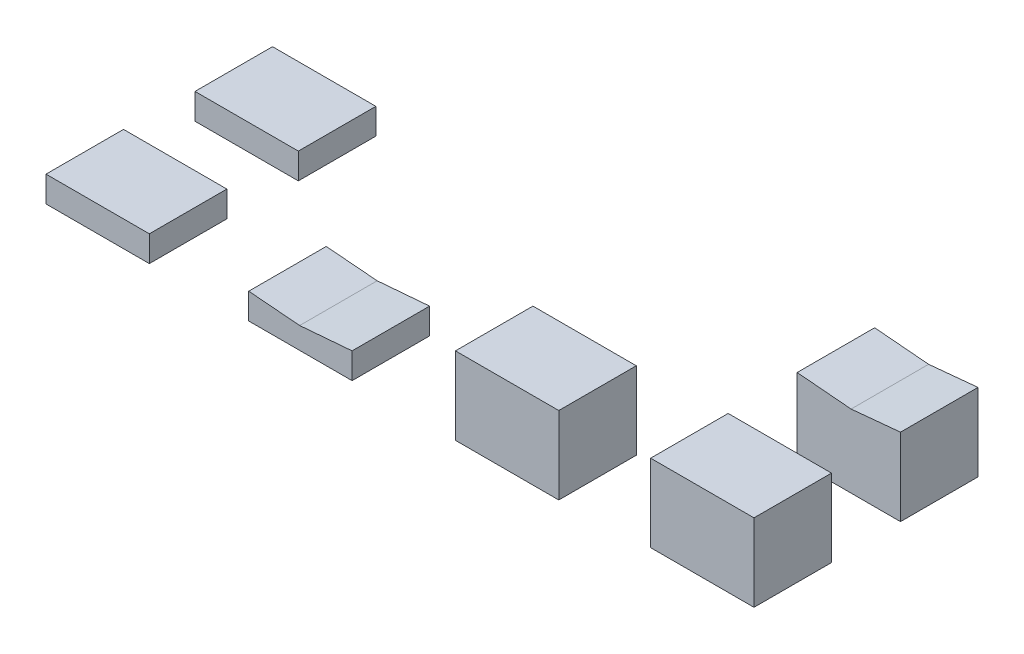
from build123d import *

# Parameters (mm, degrees)
SKETCH1_W           = 200
SKETCH1_H           = 150
BOSS_EXTRUDE1_DEPTH = 50
SKETCH5_W           = 200
SKETCH5_H           = 150
BOSS_EXTRUDE3_DEPTH = 150
SKETCH10_W          = 200
SKETCH10_H          = 150
BOSS_EXTRUDE4_DEPTH = 150
CUT_EXTRUDE1_DEPTH  = 150
CUT_EXTRUDE2_DEPTH  = 150


with BuildPart() as part:
    # Sketch1 → Boss-Extrude1 (new body)
    with BuildSketch(Plane(origin=(0, 0, 0), x_dir=(1, 0, 0), z_dir=(0, 1, 0))):
        Rectangle(SKETCH1_W, SKETCH1_H)
    extrude(amount=BOSS_EXTRUDE1_DEPTH)

    # Sketch15 → Cut-Extrude2 (cut)
    with BuildSketch(Plane.XY.offset(75)):
        Polygon((100, 50), (-100, 50), (-1.441430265, 41.712232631), align=None)
    extrude(amount=-CUT_EXTRUDE2_DEPTH, mode=Mode.SUBTRACT)


with BuildPart() as body_2:
    # Sketch5 → Boss-Extrude3 (new body)
    with BuildSketch(Plane(origin=(0, 0, 0), x_dir=(1, 0, 0), z_dir=(0, 1, 0))):
        with Locations((768.767186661, 9.019263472)):
            Rectangle(SKETCH5_W, SKETCH5_H)
    extrude(amount=BOSS_EXTRUDE3_DEPTH)


with BuildPart() as body_3:
    # Sketch10 → Boss-Extrude4 (new body)
    with BuildSketch(Plane(origin=(0, 0, 0), x_dir=(1, 0, 0), z_dir=(0, 1, 0))):
        with Locations((766.922575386, 294.381837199)):
            Rectangle(SKETCH10_W, SKETCH10_H)
    extrude(amount=BOSS_EXTRUDE4_DEPTH)

    # Sketch14 → Cut-Extrude1 (cut)
    with BuildSketch(Plane.XY.offset(-219.381837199)):
        Polygon((866.922575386, 150), (666.922575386, 150), (771.327173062, 140.936660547), align=None)
    extrude(amount=-CUT_EXTRUDE1_DEPTH, mode=Mode.SUBTRACT)


solid = Compound([part.part, body_2.part, body_3.part])
